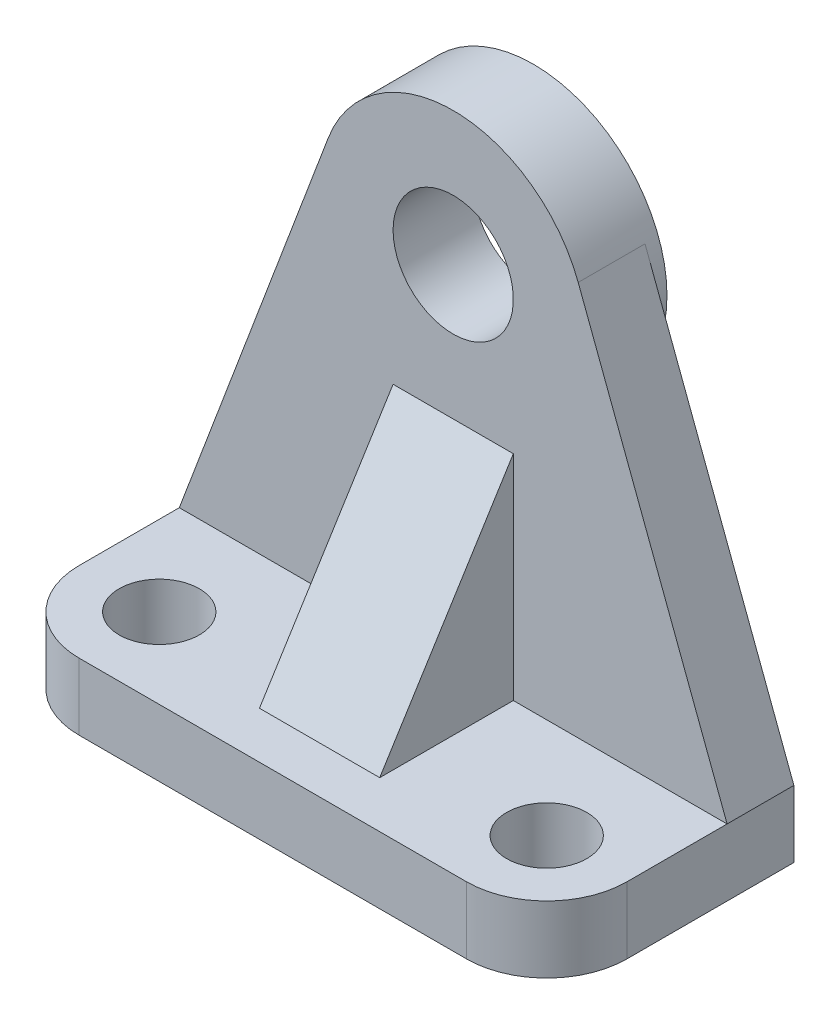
ISO-10303-21;
HEADER;
FILE_DESCRIPTION(('STEP AP214'),'2;1');
FILE_NAME('part.step','',(''),(''),'','','');
FILE_SCHEMA(('AUTOMOTIVE_DESIGN { 1 0 10303 214 1 1 1 1 }'));
ENDSEC;
DATA;
#1=APPLICATION_CONTEXT('core data for automotive mechanical design processes');
#2=APPLICATION_PROTOCOL_DEFINITION('international standard','automotive_design',2000,#1);
#3=PRODUCT_CONTEXT('',#1,'mechanical');
#4=PRODUCT('Part','Part','',(#3));
#5=PRODUCT_RELATED_PRODUCT_CATEGORY('part','',(#4));
#6=PRODUCT_DEFINITION_FORMATION('','',#4);
#7=PRODUCT_DEFINITION_CONTEXT('part definition',#1,'design');
#8=PRODUCT_DEFINITION('design','',#6,#7);
#9=PRODUCT_DEFINITION_SHAPE('','',#8);
#10=(LENGTH_UNIT() NAMED_UNIT(*) SI_UNIT(.MILLI.,.METRE.));
#11=(NAMED_UNIT(*) PLANE_ANGLE_UNIT() SI_UNIT($,.RADIAN.));
#12=(NAMED_UNIT(*) SI_UNIT($,.STERADIAN.) SOLID_ANGLE_UNIT());
#13=UNCERTAINTY_MEASURE_WITH_UNIT(LENGTH_MEASURE(1.E-05),#10,'distance_accuracy_value','');
#14=(GEOMETRIC_REPRESENTATION_CONTEXT(3) GLOBAL_UNCERTAINTY_ASSIGNED_CONTEXT((#13)) GLOBAL_UNIT_ASSIGNED_CONTEXT((#10,
#11,#12)) REPRESENTATION_CONTEXT('',''));
#15=CARTESIAN_POINT('',(0.,0.,0.));
#16=DIRECTION('',(0.,0.,1.));
#17=DIRECTION('',(1.,0.,0.));
#18=AXIS2_PLACEMENT_3D('',#15,#16,#17);
#19=CARTESIAN_POINT('',(-29.,10.,6.5));
#20=DIRECTION('',(0.,1.,0.));
#21=DIRECTION('',(0.,0.,1.));
#22=AXIS2_PLACEMENT_3D('',#19,#20,#21);
#23=PLANE('',#22);
#24=DIRECTION('',(0.,0.,-1.));
#25=VECTOR('',#24,1.);
#26=CARTESIAN_POINT('',(9.,10.,6.5));
#27=LINE('',#26,#25);
#28=CARTESIAN_POINT('',(9.,10.,11.5));
#29=VERTEX_POINT('',#28);
#30=CARTESIAN_POINT('',(9.,10.,-8.49999999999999));
#31=VERTEX_POINT('',#30);
#32=EDGE_CURVE('E61',#29,#31,#27,.T.);
#33=ORIENTED_EDGE('',*,*,#32,.F.);
#34=DIRECTION('',(-1.,0.,0.));
#35=VECTOR('',#34,1.);
#36=CARTESIAN_POINT('',(-29.,10.,11.5));
#37=LINE('',#36,#35);
#38=CARTESIAN_POINT('',(-9.,10.,11.5));
#39=VERTEX_POINT('',#38);
#40=EDGE_CURVE('E65',#39,#29,#37,.F.);
#41=ORIENTED_EDGE('',*,*,#40,.F.);
#42=DIRECTION('',(0.,0.,-1.));
#43=VECTOR('',#42,1.);
#44=CARTESIAN_POINT('',(-9.,10.,6.5));
#45=LINE('',#44,#43);
#46=CARTESIAN_POINT('',(-9.,10.,-8.49999999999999));
#47=VERTEX_POINT('',#46);
#48=EDGE_CURVE('E145',#39,#47,#45,.T.);
#49=ORIENTED_EDGE('',*,*,#48,.T.);
#50=DIRECTION('',(-1.,0.,0.));
#51=VECTOR('',#50,1.);
#52=CARTESIAN_POINT('',(41.,10.,-8.49999999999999));
#53=LINE('',#52,#51);
#54=CARTESIAN_POINT('',(-41.,10.,-8.49999999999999));
#55=VERTEX_POINT('',#54);
#56=EDGE_CURVE('E133',#47,#55,#53,.T.);
#57=ORIENTED_EDGE('',*,*,#56,.T.);
#58=DIRECTION('',(0.,0.,1.));
#59=VECTOR('',#58,1.);
#60=CARTESIAN_POINT('',(-41.,10.,-18.5));
#61=LINE('',#60,#59);
#62=CARTESIAN_POINT('',(-41.,10.,6.49999999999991));
#63=VERTEX_POINT('',#62);
#64=EDGE_CURVE('E206',#55,#63,#61,.T.);
#65=ORIENTED_EDGE('',*,*,#64,.T.);
#66=CARTESIAN_POINT('',(-29.,10.,6.5));
#67=DIRECTION('',(0.,1.,0.));
#68=DIRECTION('',(0.,0.,1.));
#69=AXIS2_PLACEMENT_3D('',#66,#67,#68);
#70=CIRCLE('',#69,12.);
#71=CARTESIAN_POINT('',(-28.9999999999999,10.,18.5));
#72=VERTEX_POINT('',#71);
#73=EDGE_CURVE('E205',#63,#72,#70,.T.);
#74=ORIENTED_EDGE('',*,*,#73,.T.);
#75=DIRECTION('',(1.,0.,0.));
#76=VECTOR('',#75,1.);
#77=CARTESIAN_POINT('',(-28.9999999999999,10.,18.5));
#78=LINE('',#77,#76);
#79=CARTESIAN_POINT('',(28.9999999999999,10.,18.5));
#80=VERTEX_POINT('',#79);
#81=EDGE_CURVE('E208',#72,#80,#78,.T.);
#82=ORIENTED_EDGE('',*,*,#81,.T.);
#83=CARTESIAN_POINT('',(29.,10.,6.5));
#84=DIRECTION('',(0.,1.,0.));
#85=DIRECTION('',(0.,0.,1.));
#86=AXIS2_PLACEMENT_3D('',#83,#84,#85);
#87=CIRCLE('',#86,12.);
#88=CARTESIAN_POINT('',(41.,10.,6.49999999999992));
#89=VERTEX_POINT('',#88);
#90=EDGE_CURVE('E210',#80,#89,#87,.T.);
#91=ORIENTED_EDGE('',*,*,#90,.T.);
#92=DIRECTION('',(0.,0.,-1.));
#93=VECTOR('',#92,1.);
#94=CARTESIAN_POINT('',(41.,10.,-18.5));
#95=LINE('',#94,#93);
#96=CARTESIAN_POINT('',(41.,10.,-8.49999999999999));
#97=VERTEX_POINT('',#96);
#98=EDGE_CURVE('E212',#89,#97,#95,.T.);
#99=ORIENTED_EDGE('',*,*,#98,.T.);
#100=EDGE_CURVE('E142',#97,#31,#53,.T.);
#101=ORIENTED_EDGE('',*,*,#100,.T.);
#102=EDGE_LOOP('',(#33,#41,#49,#57,#65,#74,#82,#91,#99,#101));
#103=FACE_BOUND('',#102,.T.);
#104=CARTESIAN_POINT('',(-29.,10.,6.5));
#105=DIRECTION('',(0.,1.,0.));
#106=DIRECTION('',(0.,0.,1.));
#107=AXIS2_PLACEMENT_3D('',#104,#105,#106);
#108=CIRCLE('',#107,6.);
#109=CARTESIAN_POINT('',(-29.,10.,12.5));
#110=VERTEX_POINT('',#109);
#111=EDGE_CURVE('E197',#110,#110,#108,.T.);
#112=ORIENTED_EDGE('',*,*,#111,.F.);
#113=EDGE_LOOP('',(#112));
#114=FACE_BOUND('',#113,.T.);
#115=CARTESIAN_POINT('',(29.,10.,6.5));
#116=DIRECTION('',(0.,1.,0.));
#117=DIRECTION('',(0.,0.,1.));
#118=AXIS2_PLACEMENT_3D('',#115,#116,#117);
#119=CIRCLE('',#118,5.99999999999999);
#120=CARTESIAN_POINT('',(29.,10.,12.5));
#121=VERTEX_POINT('',#120);
#122=EDGE_CURVE('E191',#121,#121,#119,.T.);
#123=ORIENTED_EDGE('',*,*,#122,.F.);
#124=EDGE_LOOP('',(#123));
#125=FACE_BOUND('',#124,.T.);
#126=ADVANCED_FACE('F45',(#103,#114,#125),#23,.T.);
#127=CARTESIAN_POINT('',(-29.,0.,6.5));
#128=DIRECTION('',(0.,1.,0.));
#129=DIRECTION('',(0.,0.,1.));
#130=AXIS2_PLACEMENT_3D('',#127,#128,#129);
#131=PLANE('',#130);
#132=DIRECTION('',(0.,0.,1.));
#133=VECTOR('',#132,1.);
#134=CARTESIAN_POINT('',(-41.,0.,-18.5));
#135=LINE('',#134,#133);
#136=CARTESIAN_POINT('',(-41.,0.,-18.5));
#137=VERTEX_POINT('',#136);
#138=CARTESIAN_POINT('',(-41.,0.,6.49999999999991));
#139=VERTEX_POINT('',#138);
#140=EDGE_CURVE('E200',#137,#139,#135,.T.);
#141=ORIENTED_EDGE('',*,*,#140,.F.);
#142=DIRECTION('',(-1.,0.,0.));
#143=VECTOR('',#142,1.);
#144=CARTESIAN_POINT('',(-41.,0.,-18.5));
#145=LINE('',#144,#143);
#146=CARTESIAN_POINT('',(41.,0.,-18.5));
#147=VERTEX_POINT('',#146);
#148=EDGE_CURVE('E226',#147,#137,#145,.T.);
#149=ORIENTED_EDGE('',*,*,#148,.F.);
#150=DIRECTION('',(0.,0.,-1.));
#151=VECTOR('',#150,1.);
#152=CARTESIAN_POINT('',(41.,0.,-18.5));
#153=LINE('',#152,#151);
#154=CARTESIAN_POINT('',(41.,0.,6.49999999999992));
#155=VERTEX_POINT('',#154);
#156=EDGE_CURVE('E224',#155,#147,#153,.T.);
#157=ORIENTED_EDGE('',*,*,#156,.F.);
#158=CARTESIAN_POINT('',(29.,0.,6.5));
#159=DIRECTION('',(0.,1.,0.));
#160=DIRECTION('',(0.,0.,1.));
#161=AXIS2_PLACEMENT_3D('',#158,#159,#160);
#162=CIRCLE('',#161,12.);
#163=CARTESIAN_POINT('',(28.9999999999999,0.,18.5));
#164=VERTEX_POINT('',#163);
#165=EDGE_CURVE('E222',#164,#155,#162,.T.);
#166=ORIENTED_EDGE('',*,*,#165,.F.);
#167=DIRECTION('',(1.,0.,0.));
#168=VECTOR('',#167,1.);
#169=CARTESIAN_POINT('',(-28.9999999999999,0.,18.5));
#170=LINE('',#169,#168);
#171=CARTESIAN_POINT('',(-28.9999999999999,0.,18.5));
#172=VERTEX_POINT('',#171);
#173=EDGE_CURVE('E220',#172,#164,#170,.T.);
#174=ORIENTED_EDGE('',*,*,#173,.F.);
#175=CARTESIAN_POINT('',(-29.,0.,6.5));
#176=DIRECTION('',(0.,1.,0.));
#177=DIRECTION('',(0.,0.,1.));
#178=AXIS2_PLACEMENT_3D('',#175,#176,#177);
#179=CIRCLE('',#178,12.);
#180=EDGE_CURVE('E218',#139,#172,#179,.T.);
#181=ORIENTED_EDGE('',*,*,#180,.F.);
#182=EDGE_LOOP('',(#141,#149,#157,#166,#174,#181));
#183=FACE_BOUND('',#182,.T.);
#184=CARTESIAN_POINT('',(-29.,0.,6.5));
#185=DIRECTION('',(0.,1.,0.));
#186=DIRECTION('',(0.,0.,1.));
#187=AXIS2_PLACEMENT_3D('',#184,#185,#186);
#188=CIRCLE('',#187,6.);
#189=CARTESIAN_POINT('',(-29.,0.,12.5));
#190=VERTEX_POINT('',#189);
#191=EDGE_CURVE('E194',#190,#190,#188,.T.);
#192=ORIENTED_EDGE('',*,*,#191,.T.);
#193=EDGE_LOOP('',(#192));
#194=FACE_BOUND('',#193,.T.);
#195=CARTESIAN_POINT('',(29.,0.,6.5));
#196=DIRECTION('',(0.,1.,0.));
#197=DIRECTION('',(0.,0.,1.));
#198=AXIS2_PLACEMENT_3D('',#195,#196,#197);
#199=CIRCLE('',#198,5.99999999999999);
#200=CARTESIAN_POINT('',(29.,0.,12.5));
#201=VERTEX_POINT('',#200);
#202=EDGE_CURVE('E186',#201,#201,#199,.T.);
#203=ORIENTED_EDGE('',*,*,#202,.T.);
#204=EDGE_LOOP('',(#203));
#205=FACE_BOUND('',#204,.T.);
#206=ADVANCED_FACE('F256',(#183,#194,#205),#131,.F.);
#207=CARTESIAN_POINT('',(-41.,10.,-18.5));
#208=DIRECTION('',(1.,0.,0.));
#209=DIRECTION('',(0.,0.,-1.));
#210=AXIS2_PLACEMENT_3D('',#207,#208,#209);
#211=PLANE('',#210);
#212=ORIENTED_EDGE('',*,*,#140,.T.);
#213=DIRECTION('',(0.,-1.,0.));
#214=VECTOR('',#213,1.);
#215=CARTESIAN_POINT('',(-41.,10.,6.49999999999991));
#216=LINE('',#215,#214);
#217=EDGE_CURVE('E49',#63,#139,#216,.T.);
#218=ORIENTED_EDGE('',*,*,#217,.F.);
#219=ORIENTED_EDGE('',*,*,#64,.F.);
#220=CARTESIAN_POINT('',(-41.,10.,-18.5));
#221=VERTEX_POINT('',#220);
#222=EDGE_CURVE('E203',#221,#55,#61,.T.);
#223=ORIENTED_EDGE('',*,*,#222,.F.);
#224=DIRECTION('',(0.,-1.,0.));
#225=VECTOR('',#224,1.);
#226=CARTESIAN_POINT('',(-41.,10.,-18.5));
#227=LINE('',#226,#225);
#228=EDGE_CURVE('E215',#221,#137,#227,.T.);
#229=ORIENTED_EDGE('',*,*,#228,.T.);
#230=EDGE_LOOP('',(#212,#218,#219,#223,#229));
#231=FACE_BOUND('',#230,.T.);
#232=ADVANCED_FACE('F47',(#231),#211,.F.);
#233=CARTESIAN_POINT('',(-29.,10.,6.5));
#234=DIRECTION('',(0.,-1.,0.));
#235=DIRECTION('',(0.,0.,-1.));
#236=AXIS2_PLACEMENT_3D('',#233,#234,#235);
#237=CYLINDRICAL_SURFACE('',#236,12.);
#238=ORIENTED_EDGE('',*,*,#180,.T.);
#239=DIRECTION('',(0.,-1.,0.));
#240=VECTOR('',#239,1.);
#241=CARTESIAN_POINT('',(-28.9999999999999,10.,18.5));
#242=LINE('',#241,#240);
#243=EDGE_CURVE('E238',#72,#172,#242,.T.);
#244=ORIENTED_EDGE('',*,*,#243,.F.);
#245=ORIENTED_EDGE('',*,*,#73,.F.);
#246=ORIENTED_EDGE('',*,*,#217,.T.);
#247=EDGE_LOOP('',(#238,#244,#245,#246));
#248=FACE_BOUND('',#247,.T.);
#249=ADVANCED_FACE('F248',(#248),#237,.T.);
#250=CARTESIAN_POINT('',(-28.9999999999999,10.,18.5));
#251=DIRECTION('',(0.,0.,-1.));
#252=DIRECTION('',(-1.,0.,0.));
#253=AXIS2_PLACEMENT_3D('',#250,#251,#252);
#254=PLANE('',#253);
#255=ORIENTED_EDGE('',*,*,#173,.T.);
#256=DIRECTION('',(0.,-1.,0.));
#257=VECTOR('',#256,1.);
#258=CARTESIAN_POINT('',(28.9999999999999,10.,18.5));
#259=LINE('',#258,#257);
#260=EDGE_CURVE('E236',#80,#164,#259,.T.);
#261=ORIENTED_EDGE('',*,*,#260,.F.);
#262=ORIENTED_EDGE('',*,*,#81,.F.);
#263=ORIENTED_EDGE('',*,*,#243,.T.);
#264=EDGE_LOOP('',(#255,#261,#262,#263));
#265=FACE_BOUND('',#264,.T.);
#266=ADVANCED_FACE('F261',(#265),#254,.F.);
#267=CARTESIAN_POINT('',(29.,10.,6.5));
#268=DIRECTION('',(0.,-1.,0.));
#269=DIRECTION('',(0.,0.,-1.));
#270=AXIS2_PLACEMENT_3D('',#267,#268,#269);
#271=CYLINDRICAL_SURFACE('',#270,12.);
#272=ORIENTED_EDGE('',*,*,#165,.T.);
#273=DIRECTION('',(0.,-1.,0.));
#274=VECTOR('',#273,1.);
#275=CARTESIAN_POINT('',(41.,10.,6.49999999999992));
#276=LINE('',#275,#274);
#277=EDGE_CURVE('E233',#89,#155,#276,.T.);
#278=ORIENTED_EDGE('',*,*,#277,.F.);
#279=ORIENTED_EDGE('',*,*,#90,.F.);
#280=ORIENTED_EDGE('',*,*,#260,.T.);
#281=EDGE_LOOP('',(#272,#278,#279,#280));
#282=FACE_BOUND('',#281,.T.);
#283=ADVANCED_FACE('F264',(#282),#271,.T.);
#284=CARTESIAN_POINT('',(41.,10.,-18.5));
#285=DIRECTION('',(-1.,0.,0.));
#286=DIRECTION('',(0.,0.,1.));
#287=AXIS2_PLACEMENT_3D('',#284,#285,#286);
#288=PLANE('',#287);
#289=ORIENTED_EDGE('',*,*,#156,.T.);
#290=DIRECTION('',(0.,-1.,0.));
#291=VECTOR('',#290,1.);
#292=CARTESIAN_POINT('',(41.,10.,-18.5));
#293=LINE('',#292,#291);
#294=CARTESIAN_POINT('',(41.,10.,-18.5));
#295=VERTEX_POINT('',#294);
#296=EDGE_CURVE('E230',#295,#147,#293,.T.);
#297=ORIENTED_EDGE('',*,*,#296,.F.);
#298=DIRECTION('',(0.,0.,-1.));
#299=VECTOR('',#298,1.);
#300=CARTESIAN_POINT('',(41.,10.,-8.49999999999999));
#301=LINE('',#300,#299);
#302=EDGE_CURVE('E187',#97,#295,#301,.T.);
#303=ORIENTED_EDGE('',*,*,#302,.F.);
#304=ORIENTED_EDGE('',*,*,#98,.F.);
#305=ORIENTED_EDGE('',*,*,#277,.T.);
#306=EDGE_LOOP('',(#289,#297,#303,#304,#305));
#307=FACE_BOUND('',#306,.T.);
#308=ADVANCED_FACE('F275',(#307),#288,.F.);
#309=CARTESIAN_POINT('',(-41.,10.,-18.5));
#310=DIRECTION('',(0.,0.,1.));
#311=DIRECTION('',(1.,0.,0.));
#312=AXIS2_PLACEMENT_3D('',#309,#310,#311);
#313=PLANE('',#312);
#314=ORIENTED_EDGE('',*,*,#148,.T.);
#315=ORIENTED_EDGE('',*,*,#228,.F.);
#316=DIRECTION('',(0.353067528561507,0.935597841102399,0.));
#317=VECTOR('',#316,1.);
#318=CARTESIAN_POINT('',(-41.,10.,-18.5));
#319=LINE('',#318,#317);
#320=CARTESIAN_POINT('',(-18.711956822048,69.0613505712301,-18.5));
#321=VERTEX_POINT('',#320);
#322=EDGE_CURVE('E174',#221,#321,#319,.T.);
#323=ORIENTED_EDGE('',*,*,#322,.T.);
#324=CARTESIAN_POINT('',(0.,62.,-18.5));
#325=DIRECTION('',(0.,0.,-1.));
#326=DIRECTION('',(-1.,0.,0.));
#327=AXIS2_PLACEMENT_3D('',#324,#325,#326);
#328=CIRCLE('',#327,20.);
#329=CARTESIAN_POINT('',(18.711956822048,69.0613505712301,-18.5));
#330=VERTEX_POINT('',#329);
#331=EDGE_CURVE('E13',#330,#321,#328,.T.);
#332=ORIENTED_EDGE('',*,*,#331,.F.);
#333=DIRECTION('',(0.353067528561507,-0.935597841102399,0.));
#334=VECTOR('',#333,1.);
#335=CARTESIAN_POINT('',(18.711956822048,69.0613505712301,-18.5));
#336=LINE('',#335,#334);
#337=EDGE_CURVE('E169',#330,#295,#336,.T.);
#338=ORIENTED_EDGE('',*,*,#337,.T.);
#339=ORIENTED_EDGE('',*,*,#296,.T.);
#340=EDGE_LOOP('',(#314,#315,#323,#332,#338,#339));
#341=FACE_BOUND('',#340,.T.);
#342=ADVANCED_FACE('F270',(#341),#313,.F.);
#343=CARTESIAN_POINT('',(-29.,10.,6.5));
#344=DIRECTION('',(0.,-1.,0.));
#345=DIRECTION('',(0.,0.,-1.));
#346=AXIS2_PLACEMENT_3D('',#343,#344,#345);
#347=CYLINDRICAL_SURFACE('',#346,6.);
#348=ORIENTED_EDGE('',*,*,#111,.T.);
#349=EDGE_LOOP('',(#348));
#350=FACE_BOUND('',#349,.T.);
#351=ORIENTED_EDGE('',*,*,#191,.F.);
#352=EDGE_LOOP('',(#351));
#353=FACE_BOUND('',#352,.T.);
#354=ADVANCED_FACE('F309',(#350,#353),#347,.F.);
#355=CARTESIAN_POINT('',(29.,10.,6.5));
#356=DIRECTION('',(0.,-1.,0.));
#357=DIRECTION('',(0.,0.,-1.));
#358=AXIS2_PLACEMENT_3D('',#355,#356,#357);
#359=CYLINDRICAL_SURFACE('',#358,5.99999999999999);
#360=ORIENTED_EDGE('',*,*,#122,.T.);
#361=EDGE_LOOP('',(#360));
#362=FACE_BOUND('',#361,.T.);
#363=ORIENTED_EDGE('',*,*,#202,.F.);
#364=EDGE_LOOP('',(#363));
#365=FACE_BOUND('',#364,.T.);
#366=ADVANCED_FACE('F283',(#362,#365),#359,.F.);
#367=CARTESIAN_POINT('',(0.,62.,-8.49999999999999));
#368=DIRECTION('',(0.,0.,-1.));
#369=DIRECTION('',(-1.,0.,0.));
#370=AXIS2_PLACEMENT_3D('',#367,#368,#369);
#371=CYLINDRICAL_SURFACE('',#370,20.);
#372=ORIENTED_EDGE('',*,*,#331,.T.);
#373=DIRECTION('',(0.,0.,-1.));
#374=VECTOR('',#373,1.);
#375=CARTESIAN_POINT('',(-18.711956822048,69.0613505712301,-8.49999999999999));
#376=LINE('',#375,#374);
#377=CARTESIAN_POINT('',(-18.711956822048,69.0613505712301,-8.49999999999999));
#378=VERTEX_POINT('',#377);
#379=EDGE_CURVE('E183',#378,#321,#376,.T.);
#380=ORIENTED_EDGE('',*,*,#379,.F.);
#381=CARTESIAN_POINT('',(0.,62.,-8.49999999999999));
#382=DIRECTION('',(0.,0.,-1.));
#383=DIRECTION('',(-1.,0.,0.));
#384=AXIS2_PLACEMENT_3D('',#381,#382,#383);
#385=CIRCLE('',#384,20.);
#386=CARTESIAN_POINT('',(18.711956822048,69.0613505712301,-8.49999999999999));
#387=VERTEX_POINT('',#386);
#388=EDGE_CURVE('E171',#378,#387,#385,.T.);
#389=ORIENTED_EDGE('',*,*,#388,.T.);
#390=DIRECTION('',(0.,0.,-1.));
#391=VECTOR('',#390,1.);
#392=CARTESIAN_POINT('',(18.711956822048,69.0613505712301,-8.49999999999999));
#393=LINE('',#392,#391);
#394=EDGE_CURVE('E178',#387,#330,#393,.T.);
#395=ORIENTED_EDGE('',*,*,#394,.T.);
#396=EDGE_LOOP('',(#372,#380,#389,#395));
#397=FACE_BOUND('',#396,.T.);
#398=CARTESIAN_POINT('',(0.,62.,-20.5));
#399=DIRECTION('',(0.,0.,-1.));
#400=DIRECTION('',(-1.,0.,0.));
#401=AXIS2_PLACEMENT_3D('',#398,#399,#400);
#402=CIRCLE('',#401,20.);
#403=CARTESIAN_POINT('',(-20.,62.,-20.5));
#404=VERTEX_POINT('',#403);
#405=EDGE_CURVE('E167',#404,#404,#402,.T.);
#406=ORIENTED_EDGE('',*,*,#405,.F.);
#407=EDGE_LOOP('',(#406));
#408=FACE_BOUND('',#407,.T.);
#409=ADVANCED_FACE('F280',(#397,#408),#371,.T.);
#410=CARTESIAN_POINT('',(-41.,10.,-8.49999999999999));
#411=DIRECTION('',(-0.935597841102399,0.353067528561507,0.));
#412=DIRECTION('',(-0.353067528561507,-0.935597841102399,0.));
#413=AXIS2_PLACEMENT_3D('',#410,#411,#412);
#414=PLANE('',#413);
#415=ORIENTED_EDGE('',*,*,#322,.F.);
#416=ORIENTED_EDGE('',*,*,#222,.T.);
#417=DIRECTION('',(0.353067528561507,0.935597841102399,0.));
#418=VECTOR('',#417,1.);
#419=CARTESIAN_POINT('',(-41.,10.,-8.49999999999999));
#420=LINE('',#419,#418);
#421=EDGE_CURVE('E140',#55,#378,#420,.T.);
#422=ORIENTED_EDGE('',*,*,#421,.T.);
#423=ORIENTED_EDGE('',*,*,#379,.T.);
#424=EDGE_LOOP('',(#415,#416,#422,#423));
#425=FACE_BOUND('',#424,.T.);
#426=ADVANCED_FACE('F268',(#425),#414,.T.);
#427=CARTESIAN_POINT('',(18.711956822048,69.0613505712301,-8.49999999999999));
#428=DIRECTION('',(0.935597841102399,0.353067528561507,0.));
#429=DIRECTION('',(-0.353067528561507,0.935597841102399,0.));
#430=AXIS2_PLACEMENT_3D('',#427,#428,#429);
#431=PLANE('',#430);
#432=ORIENTED_EDGE('',*,*,#337,.F.);
#433=ORIENTED_EDGE('',*,*,#394,.F.);
#434=DIRECTION('',(0.353067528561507,-0.935597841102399,0.));
#435=VECTOR('',#434,1.);
#436=CARTESIAN_POINT('',(18.711956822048,69.0613505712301,-8.49999999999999));
#437=LINE('',#436,#435);
#438=EDGE_CURVE('E143',#387,#97,#437,.T.);
#439=ORIENTED_EDGE('',*,*,#438,.T.);
#440=ORIENTED_EDGE('',*,*,#302,.T.);
#441=EDGE_LOOP('',(#432,#433,#439,#440));
#442=FACE_BOUND('',#441,.T.);
#443=ADVANCED_FACE('F277',(#442),#431,.T.);
#444=CARTESIAN_POINT('',(0.,62.,-8.49999999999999));
#445=DIRECTION('',(0.,0.,-1.));
#446=DIRECTION('',(-1.,0.,0.));
#447=AXIS2_PLACEMENT_3D('',#444,#445,#446);
#448=PLANE('',#447);
#449=CARTESIAN_POINT('',(0.,62.,-8.49999999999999));
#450=DIRECTION('',(0.,0.,-1.));
#451=DIRECTION('',(-1.,0.,0.));
#452=AXIS2_PLACEMENT_3D('',#449,#450,#451);
#453=CIRCLE('',#452,9.);
#454=CARTESIAN_POINT('',(-9.,62.,-8.49999999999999));
#455=VERTEX_POINT('',#454);
#456=EDGE_CURVE('E164',#455,#455,#453,.T.);
#457=ORIENTED_EDGE('',*,*,#456,.T.);
#458=EDGE_LOOP('',(#457));
#459=FACE_BOUND('',#458,.T.);
#460=DIRECTION('',(-1.,0.,0.));
#461=VECTOR('',#460,1.);
#462=CARTESIAN_POINT('',(0.,42.,-8.49999999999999));
#463=LINE('',#462,#461);
#464=CARTESIAN_POINT('',(-9.,42.,-8.49999999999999));
#465=VERTEX_POINT('',#464);
#466=CARTESIAN_POINT('',(9.,42.,-8.49999999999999));
#467=VERTEX_POINT('',#466);
#468=EDGE_CURVE('E155',#465,#467,#463,.F.);
#469=ORIENTED_EDGE('',*,*,#468,.T.);
#470=DIRECTION('',(0.,-1.,0.));
#471=VECTOR('',#470,1.);
#472=CARTESIAN_POINT('',(9.,62.,-8.49999999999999));
#473=LINE('',#472,#471);
#474=EDGE_CURVE('E150',#467,#31,#473,.T.);
#475=ORIENTED_EDGE('',*,*,#474,.T.);
#476=ORIENTED_EDGE('',*,*,#100,.F.);
#477=ORIENTED_EDGE('',*,*,#438,.F.);
#478=ORIENTED_EDGE('',*,*,#388,.F.);
#479=ORIENTED_EDGE('',*,*,#421,.F.);
#480=ORIENTED_EDGE('',*,*,#56,.F.);
#481=DIRECTION('',(0.,-1.,0.));
#482=VECTOR('',#481,1.);
#483=CARTESIAN_POINT('',(-9.,62.,-8.49999999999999));
#484=LINE('',#483,#482);
#485=EDGE_CURVE('E136',#465,#47,#484,.T.);
#486=ORIENTED_EDGE('',*,*,#485,.F.);
#487=EDGE_LOOP('',(#469,#475,#476,#477,#478,#479,#480,#486));
#488=FACE_BOUND('',#487,.T.);
#489=ADVANCED_FACE('F134',(#459,#488),#448,.F.);
#490=CARTESIAN_POINT('',(0.,62.,-20.5));
#491=DIRECTION('',(0.,0.,-1.));
#492=DIRECTION('',(-1.,0.,0.));
#493=AXIS2_PLACEMENT_3D('',#490,#491,#492);
#494=PLANE('',#493);
#495=CARTESIAN_POINT('',(0.,62.,-20.5));
#496=DIRECTION('',(0.,0.,-1.));
#497=DIRECTION('',(-1.,0.,0.));
#498=AXIS2_PLACEMENT_3D('',#495,#496,#497);
#499=CIRCLE('',#498,9.);
#500=CARTESIAN_POINT('',(-9.,62.,-20.5));
#501=VERTEX_POINT('',#500);
#502=EDGE_CURVE('E161',#501,#501,#499,.T.);
#503=ORIENTED_EDGE('',*,*,#502,.F.);
#504=EDGE_LOOP('',(#503));
#505=FACE_BOUND('',#504,.T.);
#506=ORIENTED_EDGE('',*,*,#405,.T.);
#507=EDGE_LOOP('',(#506));
#508=FACE_BOUND('',#507,.T.);
#509=ADVANCED_FACE('F287',(#505,#508),#494,.T.);
#510=CARTESIAN_POINT('',(0.,62.,18.5));
#511=DIRECTION('',(0.,0.,-1.));
#512=DIRECTION('',(-1.,0.,0.));
#513=AXIS2_PLACEMENT_3D('',#510,#511,#512);
#514=CYLINDRICAL_SURFACE('',#513,9.);
#515=ORIENTED_EDGE('',*,*,#502,.T.);
#516=EDGE_LOOP('',(#515));
#517=FACE_BOUND('',#516,.T.);
#518=ORIENTED_EDGE('',*,*,#456,.F.);
#519=EDGE_LOOP('',(#518));
#520=FACE_BOUND('',#519,.T.);
#521=ADVANCED_FACE('F289',(#517,#520),#514,.F.);
#522=CARTESIAN_POINT('',(0.,10.,11.5));
#523=DIRECTION('',(0.,-0.52999894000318,-0.847998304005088));
#524=DIRECTION('',(0.,0.847998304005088,-0.52999894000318));
#525=AXIS2_PLACEMENT_3D('',#522,#523,#524);
#526=PLANE('',#525);
#527=DIRECTION('',(0.,0.847998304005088,-0.52999894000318));
#528=VECTOR('',#527,1.);
#529=CARTESIAN_POINT('',(-9.,10.,11.5));
#530=LINE('',#529,#528);
#531=EDGE_CURVE('E153',#39,#465,#530,.T.);
#532=ORIENTED_EDGE('',*,*,#531,.F.);
#533=ORIENTED_EDGE('',*,*,#40,.T.);
#534=DIRECTION('',(0.,0.847998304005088,-0.52999894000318));
#535=VECTOR('',#534,1.);
#536=CARTESIAN_POINT('',(9.,10.,11.5));
#537=LINE('',#536,#535);
#538=EDGE_CURVE('E403',#29,#467,#537,.T.);
#539=ORIENTED_EDGE('',*,*,#538,.T.);
#540=ORIENTED_EDGE('',*,*,#468,.F.);
#541=EDGE_LOOP('',(#532,#533,#539,#540));
#542=FACE_BOUND('',#541,.T.);
#543=ADVANCED_FACE('F296',(#542),#526,.F.);
#544=CARTESIAN_POINT('',(9.,41.,-0.999999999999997));
#545=DIRECTION('',(1.,0.,0.));
#546=DIRECTION('',(0.,0.,-1.));
#547=AXIS2_PLACEMENT_3D('',#544,#545,#546);
#548=PLANE('',#547);
#549=ORIENTED_EDGE('',*,*,#538,.F.);
#550=ORIENTED_EDGE('',*,*,#32,.T.);
#551=ORIENTED_EDGE('',*,*,#474,.F.);
#552=EDGE_LOOP('',(#549,#550,#551));
#553=FACE_BOUND('',#552,.T.);
#554=ADVANCED_FACE('F378',(#553),#548,.T.);
#555=CARTESIAN_POINT('',(-9.,41.,-0.999999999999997));
#556=DIRECTION('',(1.,0.,0.));
#557=DIRECTION('',(0.,0.,-1.));
#558=AXIS2_PLACEMENT_3D('',#555,#556,#557);
#559=PLANE('',#558);
#560=ORIENTED_EDGE('',*,*,#48,.F.);
#561=ORIENTED_EDGE('',*,*,#531,.T.);
#562=ORIENTED_EDGE('',*,*,#485,.T.);
#563=EDGE_LOOP('',(#560,#561,#562));
#564=FACE_BOUND('',#563,.T.);
#565=ADVANCED_FACE('F152',(#564),#559,.F.);
#566=CLOSED_SHELL('',(#126,#206,#232,#249,#266,#283,#308,#342,#354,#366,#409,#426,#443,#489,
#509,#521,#543,#554,#565));
#567=MANIFOLD_SOLID_BREP('B2',#566);
#568=ADVANCED_BREP_SHAPE_REPRESENTATION('',(#18,#567),#14);
#569=SHAPE_DEFINITION_REPRESENTATION(#9,#568);
ENDSEC;
END-ISO-10303-21;
